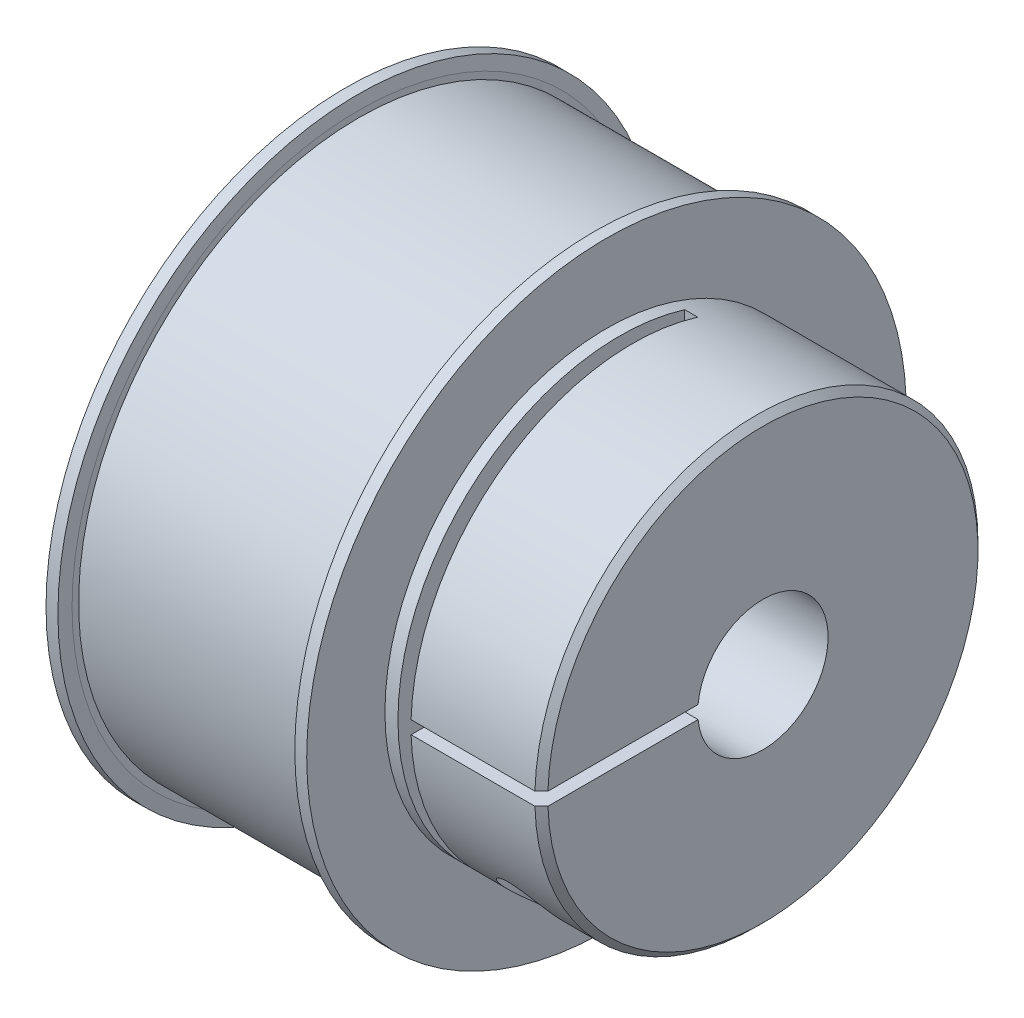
ISO-10303-21;
HEADER;
FILE_DESCRIPTION(('STEP AP214'),'2;1');
FILE_NAME('part.step','',(''),(''),'','','');
FILE_SCHEMA(('AUTOMOTIVE_DESIGN { 1 0 10303 214 1 1 1 1 }'));
ENDSEC;
DATA;
#1=APPLICATION_CONTEXT('core data for automotive mechanical design processes');
#2=APPLICATION_PROTOCOL_DEFINITION('international standard','automotive_design',2000,#1);
#3=PRODUCT_CONTEXT('',#1,'mechanical');
#4=PRODUCT('Part','Part','',(#3));
#5=PRODUCT_RELATED_PRODUCT_CATEGORY('part','',(#4));
#6=PRODUCT_DEFINITION_FORMATION('','',#4);
#7=PRODUCT_DEFINITION_CONTEXT('part definition',#1,'design');
#8=PRODUCT_DEFINITION('design','',#6,#7);
#9=PRODUCT_DEFINITION_SHAPE('','',#8);
#10=(LENGTH_UNIT() NAMED_UNIT(*) SI_UNIT(.MILLI.,.METRE.));
#11=(NAMED_UNIT(*) PLANE_ANGLE_UNIT() SI_UNIT($,.RADIAN.));
#12=(NAMED_UNIT(*) SI_UNIT($,.STERADIAN.) SOLID_ANGLE_UNIT());
#13=UNCERTAINTY_MEASURE_WITH_UNIT(LENGTH_MEASURE(1.E-05),#10,'distance_accuracy_value','');
#14=(GEOMETRIC_REPRESENTATION_CONTEXT(3) GLOBAL_UNCERTAINTY_ASSIGNED_CONTEXT((#13)) GLOBAL_UNIT_ASSIGNED_CONTEXT((#10,
#11,#12)) REPRESENTATION_CONTEXT('',''));
#15=CARTESIAN_POINT('',(0.,0.,0.));
#16=DIRECTION('',(0.,0.,1.));
#17=DIRECTION('',(1.,0.,0.));
#18=AXIS2_PLACEMENT_3D('',#15,#16,#17);
#19=CARTESIAN_POINT('',(-31.,-22.264,-22.264));
#20=DIRECTION('',(-1.,0.,0.));
#21=DIRECTION('',(0.,0.,1.));
#22=AXIS2_PLACEMENT_3D('',#19,#20,#21);
#23=PLANE('',#22);
#24=CARTESIAN_POINT('',(-31.,0.,0.));
#25=DIRECTION('',(-1.,0.,0.));
#26=DIRECTION('',(0.,-1.,0.));
#27=AXIS2_PLACEMENT_3D('',#24,#25,#26);
#28=CIRCLE('',#27,21.5);
#29=CARTESIAN_POINT('',(-31.,-21.5,0.));
#30=VERTEX_POINT('',#29);
#31=EDGE_CURVE('E22',#30,#30,#28,.T.);
#32=ORIENTED_EDGE('',*,*,#31,.T.);
#33=EDGE_LOOP('',(#32));
#34=FACE_BOUND('',#33,.T.);
#35=CARTESIAN_POINT('',(-31.,0.,0.));
#36=DIRECTION('',(-1.,0.,0.));
#37=DIRECTION('',(0.,0.,1.));
#38=AXIS2_PLACEMENT_3D('',#35,#36,#37);
#39=CIRCLE('',#38,22.0000000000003);
#40=CARTESIAN_POINT('',(-31.,0.,22.0000000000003));
#41=VERTEX_POINT('',#40);
#42=EDGE_CURVE('E237',#41,#41,#39,.F.);
#43=ORIENTED_EDGE('',*,*,#42,.T.);
#44=EDGE_LOOP('',(#43));
#45=FACE_BOUND('',#44,.T.);
#46=ADVANCED_FACE('F17',(#34,#45),#23,.F.);
#47=CARTESIAN_POINT('',(-13.,0.,0.));
#48=DIRECTION('',(-1.,0.,0.));
#49=DIRECTION('',(0.,-1.,0.));
#50=AXIS2_PLACEMENT_3D('',#47,#48,#49);
#51=CYLINDRICAL_SURFACE('',#50,21.5);
#52=ORIENTED_EDGE('',*,*,#31,.F.);
#53=EDGE_LOOP('',(#52));
#54=FACE_BOUND('',#53,.T.);
#55=CARTESIAN_POINT('',(-13.,0.,0.));
#56=DIRECTION('',(-1.,0.,0.));
#57=DIRECTION('',(0.,-1.,0.));
#58=AXIS2_PLACEMENT_3D('',#55,#56,#57);
#59=CIRCLE('',#58,21.5);
#60=CARTESIAN_POINT('',(-13.,-21.5,0.));
#61=VERTEX_POINT('',#60);
#62=EDGE_CURVE('E112',#61,#61,#59,.T.);
#63=ORIENTED_EDGE('',*,*,#62,.T.);
#64=EDGE_LOOP('',(#63));
#65=FACE_BOUND('',#64,.T.);
#66=ADVANCED_FACE('F245',(#54,#65),#51,.T.);
#67=CARTESIAN_POINT('',(-31.,0.,0.));
#68=DIRECTION('',(-1.,0.,0.));
#69=DIRECTION('',(0.,0.,1.));
#70=AXIS2_PLACEMENT_3D('',#67,#68,#69);
#71=CONICAL_SURFACE('',#70,22.,1.4835298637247);
#72=CARTESIAN_POINT('',(-31.087488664,0.,0.));
#73=DIRECTION('',(-1.,0.,0.));
#74=DIRECTION('',(0.,0.,1.));
#75=AXIS2_PLACEMENT_3D('',#72,#73,#74);
#76=CIRCLE('',#75,23.);
#77=CARTESIAN_POINT('',(-31.087488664,0.,23.));
#78=VERTEX_POINT('',#77);
#79=EDGE_CURVE('E109',#78,#78,#76,.F.);
#80=ORIENTED_EDGE('',*,*,#79,.T.);
#81=EDGE_LOOP('',(#80));
#82=FACE_BOUND('',#81,.T.);
#83=ORIENTED_EDGE('',*,*,#42,.F.);
#84=EDGE_LOOP('',(#83));
#85=FACE_BOUND('',#84,.T.);
#86=ADVANCED_FACE('F248',(#82,#85),#71,.T.);
#87=CARTESIAN_POINT('',(-13.,-22.264,22.264));
#88=DIRECTION('',(1.,0.,0.));
#89=DIRECTION('',(0.,0.,-1.));
#90=AXIS2_PLACEMENT_3D('',#87,#88,#89);
#91=PLANE('',#90);
#92=ORIENTED_EDGE('',*,*,#62,.F.);
#93=EDGE_LOOP('',(#92));
#94=FACE_BOUND('',#93,.T.);
#95=CARTESIAN_POINT('',(-13.,0.,0.));
#96=DIRECTION('',(1.,0.,0.));
#97=DIRECTION('',(0.,1.,0.));
#98=AXIS2_PLACEMENT_3D('',#95,#96,#97);
#99=CIRCLE('',#98,21.9999999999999);
#100=CARTESIAN_POINT('',(-13.,21.9999999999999,0.));
#101=VERTEX_POINT('',#100);
#102=EDGE_CURVE('E111',#101,#101,#99,.F.);
#103=ORIENTED_EDGE('',*,*,#102,.T.);
#104=EDGE_LOOP('',(#103));
#105=FACE_BOUND('',#104,.T.);
#106=ADVANCED_FACE('F252',(#94,#105),#91,.F.);
#107=CARTESIAN_POINT('',(-31.087488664,0.,0.));
#108=DIRECTION('',(-1.,0.,0.));
#109=DIRECTION('',(0.,0.,1.));
#110=AXIS2_PLACEMENT_3D('',#107,#108,#109);
#111=CYLINDRICAL_SURFACE('',#110,23.);
#112=CARTESIAN_POINT('',(-32.,0.,0.));
#113=DIRECTION('',(-1.,0.,0.));
#114=DIRECTION('',(0.,0.,1.));
#115=AXIS2_PLACEMENT_3D('',#112,#113,#114);
#116=CIRCLE('',#115,23.);
#117=CARTESIAN_POINT('',(-32.,0.,23.));
#118=VERTEX_POINT('',#117);
#119=EDGE_CURVE('E108',#118,#118,#116,.F.);
#120=ORIENTED_EDGE('',*,*,#119,.T.);
#121=EDGE_LOOP('',(#120));
#122=FACE_BOUND('',#121,.T.);
#123=ORIENTED_EDGE('',*,*,#79,.F.);
#124=EDGE_LOOP('',(#123));
#125=FACE_BOUND('',#124,.T.);
#126=ADVANCED_FACE('F255',(#122,#125),#111,.T.);
#127=CARTESIAN_POINT('',(-13.,0.,0.));
#128=DIRECTION('',(1.,0.,0.));
#129=DIRECTION('',(0.,1.,0.));
#130=AXIS2_PLACEMENT_3D('',#127,#128,#129);
#131=CONICAL_SURFACE('',#130,22.,1.48352986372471);
#132=CARTESIAN_POINT('',(-12.912511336,0.,0.));
#133=DIRECTION('',(-1.,0.,0.));
#134=DIRECTION('',(0.,0.,1.));
#135=AXIS2_PLACEMENT_3D('',#132,#133,#134);
#136=CIRCLE('',#135,23.);
#137=CARTESIAN_POINT('',(-12.912511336,0.,23.));
#138=VERTEX_POINT('',#137);
#139=EDGE_CURVE('E105',#138,#138,#136,.T.);
#140=ORIENTED_EDGE('',*,*,#139,.T.);
#141=EDGE_LOOP('',(#140));
#142=FACE_BOUND('',#141,.T.);
#143=ORIENTED_EDGE('',*,*,#102,.F.);
#144=EDGE_LOOP('',(#143));
#145=FACE_BOUND('',#144,.T.);
#146=ADVANCED_FACE('F259',(#142,#145),#131,.T.);
#147=CARTESIAN_POINT('',(-32.,-23.276,23.276));
#148=DIRECTION('',(1.,0.,0.));
#149=DIRECTION('',(0.,0.,-1.));
#150=AXIS2_PLACEMENT_3D('',#147,#148,#149);
#151=PLANE('',#150);
#152=CARTESIAN_POINT('',(-32.,0.,0.));
#153=DIRECTION('',(1.,0.,0.));
#154=DIRECTION('',(0.,0.,-1.));
#155=AXIS2_PLACEMENT_3D('',#152,#153,#154);
#156=CIRCLE('',#155,5.);
#157=CARTESIAN_POINT('',(-32.,0.,-5.));
#158=VERTEX_POINT('',#157);
#159=EDGE_CURVE('E96',#158,#158,#156,.F.);
#160=ORIENTED_EDGE('',*,*,#159,.F.);
#161=EDGE_LOOP('',(#160));
#162=FACE_BOUND('',#161,.T.);
#163=ORIENTED_EDGE('',*,*,#119,.F.);
#164=EDGE_LOOP('',(#163));
#165=FACE_BOUND('',#164,.T.);
#166=ADVANCED_FACE('F261',(#162,#165),#151,.F.);
#167=CARTESIAN_POINT('',(-12.,0.,0.));
#168=DIRECTION('',(-1.,0.,0.));
#169=DIRECTION('',(0.,0.,1.));
#170=AXIS2_PLACEMENT_3D('',#167,#168,#169);
#171=CYLINDRICAL_SURFACE('',#170,23.);
#172=ORIENTED_EDGE('',*,*,#139,.F.);
#173=EDGE_LOOP('',(#172));
#174=FACE_BOUND('',#173,.T.);
#175=CARTESIAN_POINT('',(-12.,0.,0.));
#176=DIRECTION('',(-1.,0.,0.));
#177=DIRECTION('',(0.,0.,1.));
#178=AXIS2_PLACEMENT_3D('',#175,#176,#177);
#179=CIRCLE('',#178,23.);
#180=CARTESIAN_POINT('',(-12.,0.,23.));
#181=VERTEX_POINT('',#180);
#182=EDGE_CURVE('E85',#181,#181,#179,.T.);
#183=ORIENTED_EDGE('',*,*,#182,.T.);
#184=EDGE_LOOP('',(#183));
#185=FACE_BOUND('',#184,.T.);
#186=ADVANCED_FACE('F268',(#174,#185),#171,.T.);
#187=CARTESIAN_POINT('',(-32.,0.,0.));
#188=DIRECTION('',(1.,0.,0.));
#189=DIRECTION('',(0.,0.,-1.));
#190=AXIS2_PLACEMENT_3D('',#187,#188,#189);
#191=CYLINDRICAL_SURFACE('',#190,5.);
#192=ORIENTED_EDGE('',*,*,#159,.T.);
#193=EDGE_LOOP('',(#192));
#194=FACE_BOUND('',#193,.T.);
#195=CARTESIAN_POINT('',(-11.,0.,0.));
#196=DIRECTION('',(1.,0.,0.));
#197=DIRECTION('',(0.,0.,-1.));
#198=AXIS2_PLACEMENT_3D('',#195,#196,#197);
#199=CIRCLE('',#198,5.);
#200=CARTESIAN_POINT('',(-11.,0.,-5.));
#201=VERTEX_POINT('',#200);
#202=EDGE_CURVE('E225',#201,#201,#199,.F.);
#203=ORIENTED_EDGE('',*,*,#202,.F.);
#204=EDGE_LOOP('',(#203));
#205=FACE_BOUND('',#204,.T.);
#206=ADVANCED_FACE('F280',(#194,#205),#191,.F.);
#207=CARTESIAN_POINT('',(-10.,-0.102,17.124601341));
#208=DIRECTION('',(1.,0.,0.));
#209=DIRECTION('',(0.,0.,-1.));
#210=AXIS2_PLACEMENT_3D('',#207,#208,#209);
#211=PLANE('',#210);
#212=CARTESIAN_POINT('',(-10.0000000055,0.,0.));
#213=DIRECTION('',(-1.,0.,0.));
#214=DIRECTION('',(0.,0.,1.));
#215=AXIS2_PLACEMENT_3D('',#212,#213,#214);
#216=CIRCLE('',#215,17.);
#217=CARTESIAN_POINT('',(-10.00000000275,0.500000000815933,16.9926454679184));
#218=VERTEX_POINT('',#217);
#219=CARTESIAN_POINT('',(-10.00000000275,16.2480768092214,-5.00000000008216));
#220=VERTEX_POINT('',#219);
#221=EDGE_CURVE('E99',#218,#220,#216,.T.);
#222=ORIENTED_EDGE('',*,*,#221,.T.);
#223=DIRECTION('',(0.,-1.,0.));
#224=VECTOR('',#223,1.);
#225=CARTESIAN_POINT('',(-10.,0.,-5.));
#226=LINE('',#225,#224);
#227=CARTESIAN_POINT('',(-10.,-4.48968142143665E-10,-5.));
#228=VERTEX_POINT('',#227);
#229=EDGE_CURVE('E76',#220,#228,#226,.T.);
#230=ORIENTED_EDGE('',*,*,#229,.T.);
#231=CARTESIAN_POINT('',(-10.,0.,0.));
#232=DIRECTION('',(1.,0.,0.));
#233=DIRECTION('',(0.,1.,0.));
#234=AXIS2_PLACEMENT_3D('',#231,#232,#233);
#235=CIRCLE('',#234,5.);
#236=CARTESIAN_POINT('',(-10.,0.5,4.97493718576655));
#237=VERTEX_POINT('',#236);
#238=EDGE_CURVE('E70',#237,#228,#235,.F.);
#239=ORIENTED_EDGE('',*,*,#238,.F.);
#240=DIRECTION('',(0.,0.,-1.));
#241=VECTOR('',#240,1.);
#242=CARTESIAN_POINT('',(-10.,0.5,10.983791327));
#243=LINE('',#242,#241);
#244=EDGE_CURVE('E55',#218,#237,#243,.T.);
#245=ORIENTED_EDGE('',*,*,#244,.F.);
#246=EDGE_LOOP('',(#222,#230,#239,#245));
#247=FACE_BOUND('',#246,.T.);
#248=ADVANCED_FACE('F74',(#247),#211,.F.);
#249=CARTESIAN_POINT('',(-10.,-16.248076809,-5.));
#250=DIRECTION('',(0.,0.,-1.));
#251=DIRECTION('',(-1.,0.,0.));
#252=AXIS2_PLACEMENT_3D('',#249,#250,#251);
#253=PLANE('',#252);
#254=ORIENTED_EDGE('',*,*,#229,.F.);
#255=DIRECTION('',(1.,0.,0.));
#256=VECTOR('',#255,1.);
#257=CARTESIAN_POINT('',(-6.25,16.2480768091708,-5.00000000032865));
#258=LINE('',#257,#256);
#259=CARTESIAN_POINT('',(-10.9999999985,16.2480768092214,-5.00000000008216));
#260=VERTEX_POINT('',#259);
#261=EDGE_CURVE('E101',#220,#260,#258,.F.);
#262=ORIENTED_EDGE('',*,*,#261,.T.);
#263=DIRECTION('',(0.,1.,0.));
#264=VECTOR('',#263,1.);
#265=CARTESIAN_POINT('',(-11.,0.,-5.));
#266=LINE('',#265,#264);
#267=EDGE_CURVE('E224',#201,#260,#266,.T.);
#268=ORIENTED_EDGE('',*,*,#267,.F.);
#269=DIRECTION('',(0.,1.,0.));
#270=VECTOR('',#269,1.);
#271=CARTESIAN_POINT('',(-11.,0.,-5.));
#272=LINE('',#271,#270);
#273=CARTESIAN_POINT('',(-10.9999999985,-16.248076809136,-5.));
#274=VERTEX_POINT('',#273);
#275=EDGE_CURVE('E88',#274,#201,#272,.T.);
#276=ORIENTED_EDGE('',*,*,#275,.F.);
#277=DIRECTION('',(-1.,0.,0.));
#278=VECTOR('',#277,1.);
#279=CARTESIAN_POINT('',(-10.5,-16.248076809,-5.));
#280=LINE('',#279,#278);
#281=CARTESIAN_POINT('',(-10.00000000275,-16.248076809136,-5.));
#282=VERTEX_POINT('',#281);
#283=EDGE_CURVE('E93',#282,#274,#280,.T.);
#284=ORIENTED_EDGE('',*,*,#283,.F.);
#285=DIRECTION('',(0.,1.,0.));
#286=VECTOR('',#285,1.);
#287=CARTESIAN_POINT('',(-10.,-8.5,-5.));
#288=LINE('',#287,#286);
#289=EDGE_CURVE('E103',#282,#228,#288,.T.);
#290=ORIENTED_EDGE('',*,*,#289,.T.);
#291=EDGE_LOOP('',(#254,#262,#268,#276,#284,#290));
#292=FACE_BOUND('',#291,.T.);
#293=ADVANCED_FACE('F185',(#292),#253,.F.);
#294=CARTESIAN_POINT('',(-10.,0.5,16.992645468));
#295=DIRECTION('',(0.,-1.,0.));
#296=DIRECTION('',(0.,0.,-1.));
#297=AXIS2_PLACEMENT_3D('',#294,#295,#296);
#298=PLANE('',#297);
#299=DIRECTION('',(0.,0.,1.));
#300=VECTOR('',#299,1.);
#301=CARTESIAN_POINT('',(0.,0.500000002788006,-0.00378874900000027));
#302=LINE('',#301,#300);
#303=CARTESIAN_POINT('',(0.,0.500000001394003,4.97493718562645));
#304=VERTEX_POINT('',#303);
#305=CARTESIAN_POINT('',(5.2426945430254E-10,0.500000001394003,16.4924225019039));
#306=VERTEX_POINT('',#305);
#307=EDGE_CURVE('E157',#304,#306,#302,.T.);
#308=ORIENTED_EDGE('',*,*,#307,.T.);
#309=CARTESIAN_POINT('',(1.38460002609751E-08,0.500000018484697,16.4924225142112));
#310=CARTESIAN_POINT('',(-0.083332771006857,0.500000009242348,16.5757935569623));
#311=CARTESIAN_POINT('',(-0.166665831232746,0.500000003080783,16.659164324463));
#312=CARTESIAN_POINT('',(-0.333332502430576,0.499999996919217,16.8259053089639));
#313=CARTESIAN_POINT('',(-0.416666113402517,0.499999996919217,16.909275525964));
#314=CARTESIAN_POINT('',(-0.499999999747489,0.5,16.9926454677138));
#315=B_SPLINE_CURVE_WITH_KNOTS('',3,(#309,#310,#311,#312,#313,#314),.UNSPECIFIED.,.F.,.F.,(4,2,
4),(0.,0.353632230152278,0.707264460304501),.UNSPECIFIED.);
#316=CARTESIAN_POINT('',(-0.499999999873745,0.500000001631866,16.9926454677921));
#317=VERTEX_POINT('',#316);
#318=EDGE_CURVE('E100',#306,#317,#315,.T.);
#319=ORIENTED_EDGE('',*,*,#318,.T.);
#320=DIRECTION('',(1.,0.,0.));
#321=VECTOR('',#320,1.);
#322=CARTESIAN_POINT('',(-6.25,0.500000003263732,16.9926454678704));
#323=LINE('',#322,#321);
#324=EDGE_CURVE('E66',#317,#218,#323,.F.);
#325=ORIENTED_EDGE('',*,*,#324,.T.);
#326=ORIENTED_EDGE('',*,*,#244,.T.);
#327=DIRECTION('',(1.,0.,0.));
#328=VECTOR('',#327,1.);
#329=CARTESIAN_POINT('',(-4.969993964,0.5,4.974937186));
#330=LINE('',#329,#328);
#331=EDGE_CURVE('E61',#237,#304,#330,.T.);
#332=ORIENTED_EDGE('',*,*,#331,.T.);
#333=EDGE_LOOP('',(#308,#319,#325,#326,#332));
#334=FACE_BOUND('',#333,.T.);
#335=ADVANCED_FACE('F58',(#334),#298,.T.);
#336=CARTESIAN_POINT('',(-12.,-23.276,-23.276));
#337=DIRECTION('',(-1.,0.,0.));
#338=DIRECTION('',(0.,0.,1.));
#339=AXIS2_PLACEMENT_3D('',#336,#337,#338);
#340=PLANE('',#339);
#341=CARTESIAN_POINT('',(-12.,0.,0.));
#342=DIRECTION('',(-1.,0.,0.));
#343=DIRECTION('',(0.,0.,1.));
#344=AXIS2_PLACEMENT_3D('',#341,#342,#343);
#345=CIRCLE('',#344,17.);
#346=CARTESIAN_POINT('',(-12.,0.,17.));
#347=VERTEX_POINT('',#346);
#348=EDGE_CURVE('E155',#347,#347,#345,.T.);
#349=ORIENTED_EDGE('',*,*,#348,.T.);
#350=EDGE_LOOP('',(#349));
#351=FACE_BOUND('',#350,.T.);
#352=ORIENTED_EDGE('',*,*,#182,.F.);
#353=EDGE_LOOP('',(#352));
#354=FACE_BOUND('',#353,.T.);
#355=ADVANCED_FACE('F184',(#351,#354),#340,.F.);
#356=CARTESIAN_POINT('',(-11.,-17.204,17.132));
#357=DIRECTION('',(1.,0.,0.));
#358=DIRECTION('',(0.,0.,-1.));
#359=AXIS2_PLACEMENT_3D('',#356,#357,#358);
#360=PLANE('',#359);
#361=ORIENTED_EDGE('',*,*,#202,.T.);
#362=ORIENTED_EDGE('',*,*,#267,.T.);
#363=CARTESIAN_POINT('',(-10.999999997,0.,0.));
#364=DIRECTION('',(-1.,0.,0.));
#365=DIRECTION('',(0.,0.,1.));
#366=AXIS2_PLACEMENT_3D('',#363,#364,#365);
#367=CIRCLE('',#366,17.);
#368=EDGE_CURVE('E151',#260,#274,#367,.F.);
#369=ORIENTED_EDGE('',*,*,#368,.T.);
#370=ORIENTED_EDGE('',*,*,#275,.T.);
#371=EDGE_LOOP('',(#361,#362,#369,#370));
#372=FACE_BOUND('',#371,.T.);
#373=ADVANCED_FACE('F189',(#372),#360,.T.);
#374=CARTESIAN_POINT('',(8.00644048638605E-11,0.,0.));
#375=DIRECTION('',(-1.,0.,0.));
#376=DIRECTION('',(0.,0.,1.));
#377=AXIS2_PLACEMENT_3D('',#374,#375,#376);
#378=CONICAL_SURFACE('',#377,16.4999999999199,0.785398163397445);
#379=CARTESIAN_POINT('',(-1.00131025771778E-12,0.,0.));
#380=DIRECTION('',(-1.,0.,0.));
#381=DIRECTION('',(0.,0.,1.));
#382=AXIS2_PLACEMENT_3D('',#379,#380,#381);
#383=CIRCLE('',#382,16.500000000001);
#384=CARTESIAN_POINT('',(-2.81287156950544E-10,-0.5,16.4924225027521));
#385=VERTEX_POINT('',#384);
#386=EDGE_CURVE('E162',#306,#385,#383,.T.);
#387=ORIENTED_EDGE('',*,*,#386,.T.);
#388=CARTESIAN_POINT('',(-0.499999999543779,-0.5,16.99264546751));
#389=CARTESIAN_POINT('',(-0.41666611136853,-0.5,16.9092755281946));
#390=CARTESIAN_POINT('',(-0.333332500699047,-0.5,16.825905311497));
#391=CARTESIAN_POINT('',(-0.166665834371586,-0.5,16.6591643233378));
#392=CARTESIAN_POINT('',(-0.0833327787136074,-0.5,16.5757935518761));
#393=CARTESIAN_POINT('',(-5.61395182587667E-10,-0.5,16.4924225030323));
#394=B_SPLINE_CURVE_WITH_KNOTS('',3,(#388,#389,#390,#391,#392,#393),.UNSPECIFIED.,.F.,.F.,(4,2,
4),(0.,0.353632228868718,0.707264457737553),.UNSPECIFIED.);
#395=CARTESIAN_POINT('',(-0.49999999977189,-0.5,16.992645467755));
#396=VERTEX_POINT('',#395);
#397=EDGE_CURVE('E37',#396,#385,#394,.T.);
#398=ORIENTED_EDGE('',*,*,#397,.F.);
#399=CARTESIAN_POINT('',(-0.5,0.,0.));
#400=DIRECTION('',(-1.,0.,0.));
#401=DIRECTION('',(0.,0.,1.));
#402=AXIS2_PLACEMENT_3D('',#399,#400,#401);
#403=CIRCLE('',#402,17.);
#404=EDGE_CURVE('E216',#396,#317,#403,.F.);
#405=ORIENTED_EDGE('',*,*,#404,.T.);
#406=ORIENTED_EDGE('',*,*,#318,.F.);
#407=EDGE_LOOP('',(#387,#398,#405,#406));
#408=FACE_BOUND('',#407,.T.);
#409=ADVANCED_FACE('F177',(#408),#378,.T.);
#410=CARTESIAN_POINT('',(-10.,-17.102,17.124601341));
#411=DIRECTION('',(1.,0.,0.));
#412=DIRECTION('',(0.,0.,-1.));
#413=AXIS2_PLACEMENT_3D('',#410,#411,#412);
#414=PLANE('',#413);
#415=DIRECTION('',(0.,0.,-1.));
#416=VECTOR('',#415,1.);
#417=CARTESIAN_POINT('',(-10.,-0.5,10.983791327));
#418=LINE('',#417,#416);
#419=CARTESIAN_POINT('',(-10.00000000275,-0.5,16.9926454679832));
#420=VERTEX_POINT('',#419);
#421=CARTESIAN_POINT('',(-10.,-0.5,4.97493718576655));
#422=VERTEX_POINT('',#421);
#423=EDGE_CURVE('E205',#420,#422,#418,.T.);
#424=ORIENTED_EDGE('',*,*,#423,.T.);
#425=CARTESIAN_POINT('',(-10.,0.,0.));
#426=DIRECTION('',(1.,0.,0.));
#427=DIRECTION('',(0.,1.,0.));
#428=AXIS2_PLACEMENT_3D('',#425,#426,#427);
#429=CIRCLE('',#428,5.);
#430=EDGE_CURVE('E164',#228,#422,#429,.F.);
#431=ORIENTED_EDGE('',*,*,#430,.F.);
#432=ORIENTED_EDGE('',*,*,#289,.F.);
#433=CARTESIAN_POINT('',(-10.0000000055,0.,0.));
#434=DIRECTION('',(-1.,0.,0.));
#435=DIRECTION('',(0.,0.,1.));
#436=AXIS2_PLACEMENT_3D('',#433,#434,#435);
#437=CIRCLE('',#436,17.);
#438=EDGE_CURVE('E121',#282,#420,#437,.T.);
#439=ORIENTED_EDGE('',*,*,#438,.T.);
#440=EDGE_LOOP('',(#424,#431,#432,#439));
#441=FACE_BOUND('',#440,.T.);
#442=ADVANCED_FACE('F193',(#441),#414,.F.);
#443=CARTESIAN_POINT('',(-10.,0.,0.));
#444=DIRECTION('',(1.,0.,0.));
#445=DIRECTION('',(0.,1.,0.));
#446=AXIS2_PLACEMENT_3D('',#443,#444,#445);
#447=CYLINDRICAL_SURFACE('',#446,5.);
#448=DIRECTION('',(1.,0.,0.));
#449=VECTOR('',#448,1.);
#450=CARTESIAN_POINT('',(-4.969993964,-0.5,4.974937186));
#451=LINE('',#450,#449);
#452=CARTESIAN_POINT('',(-2.24720282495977E-09,-0.5,4.97493718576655));
#453=VERTEX_POINT('',#452);
#454=EDGE_CURVE('E212',#422,#453,#451,.T.);
#455=ORIENTED_EDGE('',*,*,#454,.T.);
#456=CARTESIAN_POINT('',(0.,0.,0.));
#457=DIRECTION('',(1.,0.,0.));
#458=DIRECTION('',(0.,1.,0.));
#459=AXIS2_PLACEMENT_3D('',#456,#457,#458);
#460=CIRCLE('',#459,5.);
#461=EDGE_CURVE('E84',#453,#304,#460,.T.);
#462=ORIENTED_EDGE('',*,*,#461,.T.);
#463=ORIENTED_EDGE('',*,*,#331,.F.);
#464=ORIENTED_EDGE('',*,*,#238,.T.);
#465=ORIENTED_EDGE('',*,*,#430,.T.);
#466=EDGE_LOOP('',(#455,#462,#463,#464,#465));
#467=FACE_BOUND('',#466,.T.);
#468=ADVANCED_FACE('F83',(#467),#447,.F.);
#469=CARTESIAN_POINT('',(0.,-16.698,-16.697954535));
#470=DIRECTION('',(-1.,0.,0.));
#471=DIRECTION('',(0.,0.,1.));
#472=AXIS2_PLACEMENT_3D('',#469,#470,#471);
#473=PLANE('',#472);
#474=ORIENTED_EDGE('',*,*,#461,.F.);
#475=DIRECTION('',(0.,0.,1.));
#476=VECTOR('',#475,1.);
#477=CARTESIAN_POINT('',(-4.49440541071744E-09,-0.5,10.983791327));
#478=LINE('',#477,#476);
#479=EDGE_CURVE('E120',#453,#385,#478,.T.);
#480=ORIENTED_EDGE('',*,*,#479,.T.);
#481=ORIENTED_EDGE('',*,*,#386,.F.);
#482=ORIENTED_EDGE('',*,*,#307,.F.);
#483=EDGE_LOOP('',(#474,#480,#481,#482));
#484=FACE_BOUND('',#483,.T.);
#485=ADVANCED_FACE('F140',(#484),#473,.F.);
#486=CARTESIAN_POINT('',(-0.5,0.,0.));
#487=DIRECTION('',(-1.,0.,0.));
#488=DIRECTION('',(0.,0.,1.));
#489=AXIS2_PLACEMENT_3D('',#486,#487,#488);
#490=CYLINDRICAL_SURFACE('',#489,17.);
#491=ORIENTED_EDGE('',*,*,#368,.F.);
#492=ORIENTED_EDGE('',*,*,#261,.F.);
#493=ORIENTED_EDGE('',*,*,#221,.F.);
#494=ORIENTED_EDGE('',*,*,#324,.F.);
#495=ORIENTED_EDGE('',*,*,#404,.F.);
#496=DIRECTION('',(-1.,0.,0.));
#497=VECTOR('',#496,1.);
#498=CARTESIAN_POINT('',(-4.969993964,-0.5,16.992645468));
#499=LINE('',#498,#497);
#500=EDGE_CURVE('E213',#396,#420,#499,.T.);
#501=ORIENTED_EDGE('',*,*,#500,.T.);
#502=ORIENTED_EDGE('',*,*,#438,.F.);
#503=ORIENTED_EDGE('',*,*,#283,.T.);
#504=EDGE_LOOP('',(#491,#492,#493,#494,#495,#501,#502,#503));
#505=FACE_BOUND('',#504,.T.);
#506=ORIENTED_EDGE('',*,*,#348,.F.);
#507=EDGE_LOOP('',(#506));
#508=FACE_BOUND('',#507,.T.);
#509=CARTESIAN_POINT('',(-5.34977584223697,-9.34788108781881,14.1991943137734));
#510=CARTESIAN_POINT('',(-5.42256963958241,-9.34788786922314,14.1991903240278));
#511=CARTESIAN_POINT('',(-5.49540236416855,-9.35343260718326,14.1955442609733));
#512=CARTESIAN_POINT('',(-5.6388149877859,-9.37499270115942,14.181314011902));
#513=CARTESIAN_POINT('',(-5.70939177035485,-9.39102193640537,14.1707206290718));
#514=CARTESIAN_POINT('',(-5.86323738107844,-9.43696437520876,14.1401776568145));
#515=CARTESIAN_POINT('',(-5.9454465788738,-9.46929814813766,14.1185846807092));
#516=CARTESIAN_POINT('',(-6.10252978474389,-9.54427306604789,14.0680098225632));
#517=CARTESIAN_POINT('',(-6.1773889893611,-9.58693443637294,14.0390134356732));
#518=CARTESIAN_POINT('',(-6.35829762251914,-9.70470322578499,13.9580148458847));
#519=CARTESIAN_POINT('',(-6.45924797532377,-9.78486037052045,13.9020638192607));
#520=CARTESIAN_POINT('',(-6.64544070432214,-9.95537000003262,13.7804813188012));
#521=CARTESIAN_POINT('',(-6.73064237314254,-10.0457479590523,13.714825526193));
#522=CARTESIAN_POINT('',(-6.87195500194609,-10.214416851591,13.5895003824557));
#523=CARTESIAN_POINT('',(-6.93050510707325,-10.2916640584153,13.5311297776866));
#524=CARTESIAN_POINT('',(-7.03928164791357,-10.4487572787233,13.4101939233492));
#525=CARTESIAN_POINT('',(-7.08950322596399,-10.5286047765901,13.3476262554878));
#526=CARTESIAN_POINT('',(-7.18209074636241,-10.6899517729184,13.218759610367));
#527=CARTESIAN_POINT('',(-7.22444924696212,-10.771452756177,13.1524571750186));
#528=CARTESIAN_POINT('',(-7.30148406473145,-10.9352893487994,13.0165578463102));
#529=CARTESIAN_POINT('',(-7.33616184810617,-11.0176247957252,12.9469615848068));
#530=CARTESIAN_POINT('',(-7.39915978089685,-11.1859326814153,12.8018646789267));
#531=CARTESIAN_POINT('',(-7.42716305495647,-11.2719165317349,12.7262389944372));
#532=CARTESIAN_POINT('',(-7.47479157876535,-11.4436081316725,12.5720799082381));
#533=CARTESIAN_POINT('',(-7.49441368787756,-11.5293157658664,12.4935454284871));
#534=CARTESIAN_POINT('',(-7.54024745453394,-11.7850347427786,12.2542695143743));
#535=CARTESIAN_POINT('',(-7.55354918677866,-11.9539688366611,12.0895749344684));
#536=CARTESIAN_POINT('',(-7.54259648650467,-12.2567882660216,11.7817612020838));
#537=CARTESIAN_POINT('',(-7.52418684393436,-12.3918510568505,11.6395759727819));
#538=CARTESIAN_POINT('',(-7.45716917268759,-12.6535987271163,11.3544546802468));
#539=CARTESIAN_POINT('',(-7.40859781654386,-12.7802935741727,11.2115197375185));
#540=CARTESIAN_POINT('',(-7.29278424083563,-12.9935925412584,10.9629821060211));
#541=CARTESIAN_POINT('',(-7.23240371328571,-13.0827162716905,10.8563528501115));
#542=CARTESIAN_POINT('',(-7.09026756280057,-13.2513213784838,10.649889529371));
#543=CARTESIAN_POINT('',(-7.00854104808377,-13.3308156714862,10.5500464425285));
#544=CARTESIAN_POINT('',(-6.84033507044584,-13.4639196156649,10.3794211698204));
#545=CARTESIAN_POINT('',(-6.75750152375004,-13.5196002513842,10.3066730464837));
#546=CARTESIAN_POINT('',(-6.5778499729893,-13.6210709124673,10.1721933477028));
#547=CARTESIAN_POINT('',(-6.48103104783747,-13.6668602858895,10.1104624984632));
#548=CARTESIAN_POINT('',(-6.27413913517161,-13.7471261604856,10.0010602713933));
#549=CARTESIAN_POINT('',(-6.16396575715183,-13.781508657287,9.95350603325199));
#550=CARTESIAN_POINT('',(-5.99197813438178,-13.8229495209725,9.89578788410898));
#551=CARTESIAN_POINT('',(-5.9335578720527,-13.8350708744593,9.87882234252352));
#552=CARTESIAN_POINT('',(-5.81493807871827,-13.8558208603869,9.84969800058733));
#553=CARTESIAN_POINT('',(-5.75473958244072,-13.8644514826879,9.83753646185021));
#554=CARTESIAN_POINT('',(-5.63727847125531,-13.8776381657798,9.81892462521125));
#555=CARTESIAN_POINT('',(-5.58009494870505,-13.8824315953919,9.8121419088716));
#556=CARTESIAN_POINT('',(-5.46521005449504,-13.8888316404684,9.80308019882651));
#557=CARTESIAN_POINT('',(-5.40750870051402,-13.8904383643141,9.80080105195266));
#558=CARTESIAN_POINT('',(-5.24369920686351,-13.8904312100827,9.80081420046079));
#559=CARTESIAN_POINT('',(-5.13751621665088,-13.8849938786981,9.80853259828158));
#560=CARTESIAN_POINT('',(-4.92835345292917,-13.8634439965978,9.83896585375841));
#561=CARTESIAN_POINT('',(-4.82537871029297,-13.8473154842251,9.86170313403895));
#562=CARTESIAN_POINT('',(-4.62599713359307,-13.8050873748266,9.92072887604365));
#563=CARTESIAN_POINT('',(-4.52956793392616,-13.7790239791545,9.95696812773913));
#564=CARTESIAN_POINT('',(-4.34510048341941,-13.7178502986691,10.0410794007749));
#565=CARTESIAN_POINT('',(-4.25706149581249,-13.6827408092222,10.0889503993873));
#566=CARTESIAN_POINT('',(-4.08634356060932,-13.602450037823,10.1969651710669));
#567=CARTESIAN_POINT('',(-4.00420122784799,-13.5568313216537,10.2576274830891));
#568=CARTESIAN_POINT('',(-3.85162701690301,-13.4580284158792,10.3869203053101));
#569=CARTESIAN_POINT('',(-3.78120131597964,-13.4048402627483,10.4555549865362));
#570=CARTESIAN_POINT('',(-3.62449715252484,-13.2678100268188,10.6293019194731));
#571=CARTESIAN_POINT('',(-3.54443261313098,-13.1806242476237,10.7374044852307));
#572=CARTESIAN_POINT('',(-3.40772104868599,-12.9962926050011,10.9598078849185));
#573=CARTESIAN_POINT('',(-3.3511240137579,-12.8991260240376,11.0741213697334));
#574=CARTESIAN_POINT('',(-3.24551641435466,-12.6662156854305,11.3405047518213));
#575=CARTESIAN_POINT('',(-3.20425485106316,-12.5278295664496,11.4933259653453));
#576=CARTESIAN_POINT('',(-3.15464539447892,-12.2429442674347,11.7963447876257));
#577=CARTESIAN_POINT('',(-3.14630750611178,-12.0964426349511,11.9465415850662));
#578=CARTESIAN_POINT('',(-3.1589690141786,-11.7956925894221,12.2436608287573));
#579=CARTESIAN_POINT('',(-3.18056132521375,-11.6413476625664,12.3904568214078));
#580=CARTESIAN_POINT('',(-3.25170871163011,-11.3303948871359,12.6754372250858));
#581=CARTESIAN_POINT('',(-3.30133619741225,-11.1737822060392,12.8135983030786));
#582=CARTESIAN_POINT('',(-3.40286750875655,-10.9235015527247,13.0266110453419));
#583=CARTESIAN_POINT('',(-3.44621111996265,-10.8292859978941,13.1050037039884));
#584=CARTESIAN_POINT('',(-3.54316053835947,-10.6423224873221,13.25728051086));
#585=CARTESIAN_POINT('',(-3.59677312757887,-10.5495755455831,13.3311616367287));
#586=CARTESIAN_POINT('',(-3.71448821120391,-10.3673532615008,13.4733545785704));
#587=CARTESIAN_POINT('',(-3.7785397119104,-10.2778644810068,13.5416911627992));
#588=CARTESIAN_POINT('',(-3.91819293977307,-10.1036415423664,13.6721695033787));
#589=CARTESIAN_POINT('',(-3.99377622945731,-10.018900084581,13.7343208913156));
#590=CARTESIAN_POINT('',(-4.13820856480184,-9.87645861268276,13.8369551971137));
#591=CARTESIAN_POINT('',(-4.20431028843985,-9.81715435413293,13.8790558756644));
#592=CARTESIAN_POINT('',(-4.34483847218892,-9.70484695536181,13.9578165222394));
#593=CARTESIAN_POINT('',(-4.41927047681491,-9.6518480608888,13.9944728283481));
#594=CARTESIAN_POINT('',(-4.57802613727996,-9.55444018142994,14.0611592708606));
#595=CARTESIAN_POINT('',(-4.66246990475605,-9.51015699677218,14.0910931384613));
#596=CARTESIAN_POINT('',(-4.83989397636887,-9.43544654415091,14.1412306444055));
#597=CARTESIAN_POINT('',(-4.9328385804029,-9.40496426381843,14.1614729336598));
#598=CARTESIAN_POINT('',(-5.08097525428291,-9.37191377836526,14.1833501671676));
#599=CARTESIAN_POINT('',(-5.13415415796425,-9.36295549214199,14.1892605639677));
#600=CARTESIAN_POINT('',(-5.24147351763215,-9.35093683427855,14.1971839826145));
#601=CARTESIAN_POINT('',(-5.29561390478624,-9.3478760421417,14.1991972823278));
#602=CARTESIAN_POINT('',(-5.34977584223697,-9.34788108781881,14.1991943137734));
#603=B_SPLINE_CURVE_WITH_KNOTS('',3,(#509,#510,#511,#512,#513,#514,#515,#516,#517,#518,#519,
#520,#521,#522,#523,#524,#525,#526,#527,#528,#529,#530,#531,#532,#533,#534,#535,#536,#537,#538,
#539,#540,#541,#542,#543,#544,#545,#546,#547,#548,#549,#550,#551,#552,#553,#554,#555,#556,#557,
#558,#559,#560,#561,#562,#563,#564,#565,#566,#567,#568,#569,#570,#571,#572,#573,#574,#575,#576,
#577,#578,#579,#580,#581,#582,#583,#584,#585,#586,#587,#588,#589,#590,#591,#592,#593,#594,#595,
#596,#597,#598,#599,#600,#601,#602),.UNSPECIFIED.,.T.,.F.,(4,2,2,2,2,2,2,2,2,2,2,2,2,2,2,2,2,2,
2,2,2,2,2,2,2,2,2,2,2,2,2,2,2,2,2,2,2,2,2,2,2,2,2,2,2,2,4),(0.,0.218163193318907,
0.436615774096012,0.707911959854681,0.979743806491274,1.3989805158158,1.81928616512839,
2.15828816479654,2.49748719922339,2.83700563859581,3.17645920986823,3.52975353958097,
3.88318014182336,4.58870303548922,5.17759844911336,5.76577924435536,6.21870758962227,
6.67102149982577,7.04005199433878,7.40910680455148,7.78113154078,7.966962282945,
8.15268694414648,8.3257690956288,8.49884536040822,8.81685054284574,9.13533157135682,
9.45266302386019,9.76996658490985,10.1041999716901,10.4386090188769,10.916880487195,
11.3961655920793,12.0235592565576,12.6511435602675,13.2913394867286,13.9331965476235,
14.322792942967,14.7126475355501,15.1006518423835,15.4880421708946,15.7823285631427,
16.0768120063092,16.3752761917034,16.6725399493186,16.8348749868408,16.997198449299),.UNSPECIFIED.);
#604=CARTESIAN_POINT('',(-5.34977584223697,-9.34788108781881,14.1991943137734));
#605=VERTEX_POINT('',#604);
#606=EDGE_CURVE('E28',#605,#605,#603,.T.);
#607=ORIENTED_EDGE('',*,*,#606,.F.);
#608=EDGE_LOOP('',(#607));
#609=FACE_BOUND('',#608,.T.);
#610=ADVANCED_FACE('F123',(#505,#508,#609),#490,.T.);
#611=CARTESIAN_POINT('',(-10.,-0.5,16.992645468));
#612=DIRECTION('',(0.,-1.,0.));
#613=DIRECTION('',(0.,0.,-1.));
#614=AXIS2_PLACEMENT_3D('',#611,#612,#613);
#615=PLANE('',#614);
#616=CARTESIAN_POINT('',(-5.349775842,-0.5,12.));
#617=DIRECTION('',(0.,1.,0.));
#618=DIRECTION('',(-1.,0.,0.));
#619=AXIS2_PLACEMENT_3D('',#616,#617,#618);
#620=CIRCLE('',#619,2.199194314);
#621=CARTESIAN_POINT('',(-7.54897015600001,-0.500000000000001,12.));
#622=VERTEX_POINT('',#621);
#623=EDGE_CURVE('E11',#622,#622,#620,.T.);
#624=ORIENTED_EDGE('',*,*,#623,.F.);
#625=EDGE_LOOP('',(#624));
#626=FACE_BOUND('',#625,.T.);
#627=ORIENTED_EDGE('',*,*,#479,.F.);
#628=ORIENTED_EDGE('',*,*,#454,.F.);
#629=ORIENTED_EDGE('',*,*,#423,.F.);
#630=ORIENTED_EDGE('',*,*,#500,.F.);
#631=ORIENTED_EDGE('',*,*,#397,.T.);
#632=EDGE_LOOP('',(#627,#628,#629,#630,#631));
#633=FACE_BOUND('',#632,.T.);
#634=ADVANCED_FACE('F19',(#626,#633),#615,.F.);
#635=CARTESIAN_POINT('',(-5.349775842,-13.970778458,12.));
#636=DIRECTION('',(0.,1.,0.));
#637=DIRECTION('',(-1.,0.,0.));
#638=AXIS2_PLACEMENT_3D('',#635,#636,#637);
#639=CYLINDRICAL_SURFACE('',#638,2.199194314);
#640=ORIENTED_EDGE('',*,*,#623,.T.);
#641=EDGE_LOOP('',(#640));
#642=FACE_BOUND('',#641,.T.);
#643=ORIENTED_EDGE('',*,*,#606,.T.);
#644=EDGE_LOOP('',(#643));
#645=FACE_BOUND('',#644,.T.);
#646=ADVANCED_FACE('F126',(#642,#645),#639,.F.);
#647=CLOSED_SHELL('',(#46,#66,#86,#106,#126,#146,#166,#186,#206,#248,#293,#335,#355,#373,#409,
#442,#468,#485,#610,#634,#646));
#648=MANIFOLD_SOLID_BREP('B1',#647);
#649=ADVANCED_BREP_SHAPE_REPRESENTATION('',(#18,#648),#14);
#650=SHAPE_DEFINITION_REPRESENTATION(#9,#649);
ENDSEC;
END-ISO-10303-21;
